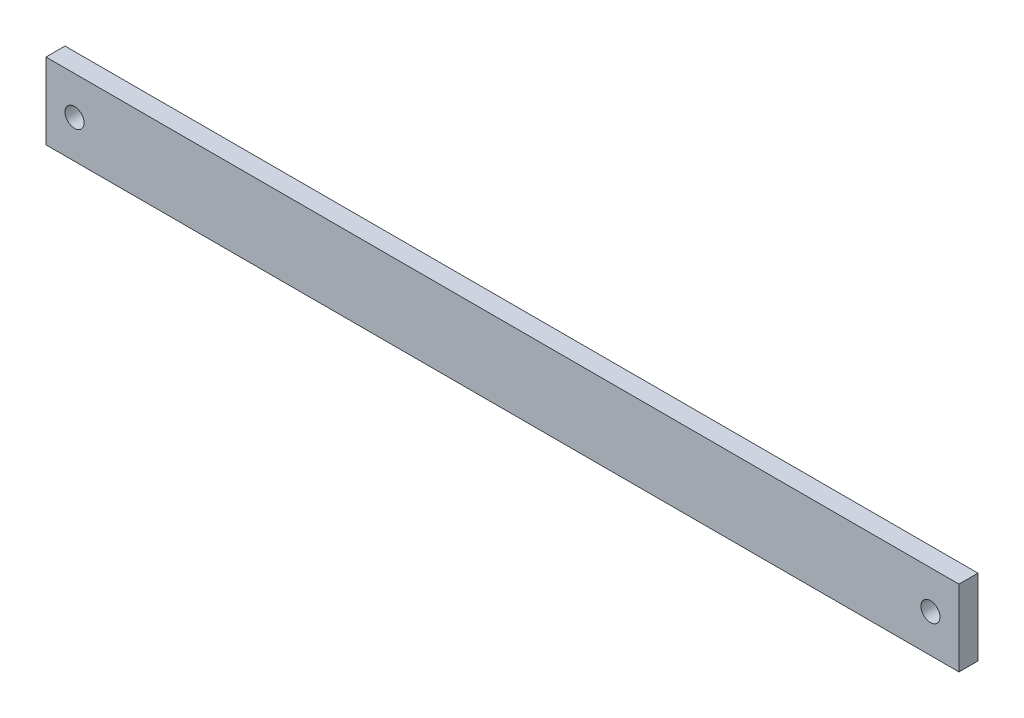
ISO-10303-21;
HEADER;
FILE_DESCRIPTION(('STEP AP214'),'2;1');
FILE_NAME('part.step','',(''),(''),'','','');
FILE_SCHEMA(('AUTOMOTIVE_DESIGN { 1 0 10303 214 1 1 1 1 }'));
ENDSEC;
DATA;
#1=APPLICATION_CONTEXT('core data for automotive mechanical design processes');
#2=APPLICATION_PROTOCOL_DEFINITION('international standard','automotive_design',2000,#1);
#3=PRODUCT_CONTEXT('',#1,'mechanical');
#4=PRODUCT('Part','Part','',(#3));
#5=PRODUCT_RELATED_PRODUCT_CATEGORY('part','',(#4));
#6=PRODUCT_DEFINITION_FORMATION('','',#4);
#7=PRODUCT_DEFINITION_CONTEXT('part definition',#1,'design');
#8=PRODUCT_DEFINITION('design','',#6,#7);
#9=PRODUCT_DEFINITION_SHAPE('','',#8);
#10=(LENGTH_UNIT() NAMED_UNIT(*) SI_UNIT(.MILLI.,.METRE.));
#11=(NAMED_UNIT(*) PLANE_ANGLE_UNIT() SI_UNIT($,.RADIAN.));
#12=(NAMED_UNIT(*) SI_UNIT($,.STERADIAN.) SOLID_ANGLE_UNIT());
#13=UNCERTAINTY_MEASURE_WITH_UNIT(LENGTH_MEASURE(1.E-05),#10,'distance_accuracy_value','');
#14=(GEOMETRIC_REPRESENTATION_CONTEXT(3) GLOBAL_UNCERTAINTY_ASSIGNED_CONTEXT((#13)) GLOBAL_UNIT_ASSIGNED_CONTEXT((#10,
#11,#12)) REPRESENTATION_CONTEXT('',''));
#15=CARTESIAN_POINT('',(0.,0.,0.));
#16=DIRECTION('',(0.,0.,1.));
#17=DIRECTION('',(1.,0.,0.));
#18=AXIS2_PLACEMENT_3D('',#15,#16,#17);
#19=CARTESIAN_POINT('',(-152.4,307.975,6.35));
#20=DIRECTION('',(1.,0.,0.));
#21=DIRECTION('',(0.,0.,-1.));
#22=AXIS2_PLACEMENT_3D('',#19,#20,#21);
#23=PLANE('',#22);
#24=DIRECTION('',(0.,-1.,0.));
#25=VECTOR('',#24,1.);
#26=CARTESIAN_POINT('',(-152.4,307.975,0.));
#27=LINE('',#26,#25);
#28=CARTESIAN_POINT('',(-152.4,307.975,0.));
#29=VERTEX_POINT('',#28);
#30=CARTESIAN_POINT('',(-152.4,282.575,0.));
#31=VERTEX_POINT('',#30);
#32=EDGE_CURVE('E94',#29,#31,#27,.T.);
#33=ORIENTED_EDGE('',*,*,#32,.T.);
#34=DIRECTION('',(0.,0.,-1.));
#35=VECTOR('',#34,1.);
#36=CARTESIAN_POINT('',(-152.4,282.575,6.35));
#37=LINE('',#36,#35);
#38=CARTESIAN_POINT('',(-152.4,282.575,6.35));
#39=VERTEX_POINT('',#38);
#40=EDGE_CURVE('E11',#39,#31,#37,.T.);
#41=ORIENTED_EDGE('',*,*,#40,.F.);
#42=DIRECTION('',(0.,-1.,0.));
#43=VECTOR('',#42,1.);
#44=CARTESIAN_POINT('',(-152.4,307.975,6.35));
#45=LINE('',#44,#43);
#46=CARTESIAN_POINT('',(-152.4,307.975,6.35));
#47=VERTEX_POINT('',#46);
#48=EDGE_CURVE('E82',#47,#39,#45,.T.);
#49=ORIENTED_EDGE('',*,*,#48,.F.);
#50=DIRECTION('',(0.,0.,-1.));
#51=VECTOR('',#50,1.);
#52=CARTESIAN_POINT('',(-152.4,307.975,6.35));
#53=LINE('',#52,#51);
#54=EDGE_CURVE('E90',#47,#29,#53,.T.);
#55=ORIENTED_EDGE('',*,*,#54,.T.);
#56=EDGE_LOOP('',(#33,#41,#49,#55));
#57=FACE_BOUND('',#56,.T.);
#58=ADVANCED_FACE('F31',(#57),#23,.F.);
#59=CARTESIAN_POINT('',(-152.4,282.575,6.35));
#60=DIRECTION('',(0.,1.,0.));
#61=DIRECTION('',(0.,0.,1.));
#62=AXIS2_PLACEMENT_3D('',#59,#60,#61);
#63=PLANE('',#62);
#64=DIRECTION('',(1.,0.,0.));
#65=VECTOR('',#64,1.);
#66=CARTESIAN_POINT('',(-152.4,282.575,0.));
#67=LINE('',#66,#65);
#68=CARTESIAN_POINT('',(152.4,282.575,0.));
#69=VERTEX_POINT('',#68);
#70=EDGE_CURVE('E86',#31,#69,#67,.T.);
#71=ORIENTED_EDGE('',*,*,#70,.T.);
#72=DIRECTION('',(0.,0.,-1.));
#73=VECTOR('',#72,1.);
#74=CARTESIAN_POINT('',(152.4,282.575,6.35));
#75=LINE('',#74,#73);
#76=CARTESIAN_POINT('',(152.4,282.575,6.35));
#77=VERTEX_POINT('',#76);
#78=EDGE_CURVE('E39',#77,#69,#75,.T.);
#79=ORIENTED_EDGE('',*,*,#78,.F.);
#80=DIRECTION('',(1.,0.,0.));
#81=VECTOR('',#80,1.);
#82=CARTESIAN_POINT('',(-152.4,282.575,6.35));
#83=LINE('',#82,#81);
#84=EDGE_CURVE('E77',#39,#77,#83,.T.);
#85=ORIENTED_EDGE('',*,*,#84,.F.);
#86=ORIENTED_EDGE('',*,*,#40,.T.);
#87=EDGE_LOOP('',(#71,#79,#85,#86));
#88=FACE_BOUND('',#87,.T.);
#89=ADVANCED_FACE('F85',(#88),#63,.F.);
#90=CARTESIAN_POINT('',(152.4,307.975,6.35));
#91=DIRECTION('',(-1.,0.,0.));
#92=DIRECTION('',(0.,0.,1.));
#93=AXIS2_PLACEMENT_3D('',#90,#91,#92);
#94=PLANE('',#93);
#95=DIRECTION('',(0.,1.,0.));
#96=VECTOR('',#95,1.);
#97=CARTESIAN_POINT('',(152.4,307.975,0.));
#98=LINE('',#97,#96);
#99=CARTESIAN_POINT('',(152.4,307.975,0.));
#100=VERTEX_POINT('',#99);
#101=EDGE_CURVE('E64',#69,#100,#98,.T.);
#102=ORIENTED_EDGE('',*,*,#101,.T.);
#103=DIRECTION('',(0.,0.,-1.));
#104=VECTOR('',#103,1.);
#105=CARTESIAN_POINT('',(152.4,307.975,6.35));
#106=LINE('',#105,#104);
#107=CARTESIAN_POINT('',(152.4,307.975,6.35));
#108=VERTEX_POINT('',#107);
#109=EDGE_CURVE('E87',#108,#100,#106,.T.);
#110=ORIENTED_EDGE('',*,*,#109,.F.);
#111=DIRECTION('',(0.,1.,0.));
#112=VECTOR('',#111,1.);
#113=CARTESIAN_POINT('',(152.4,307.975,6.35));
#114=LINE('',#113,#112);
#115=EDGE_CURVE('E80',#77,#108,#114,.T.);
#116=ORIENTED_EDGE('',*,*,#115,.F.);
#117=ORIENTED_EDGE('',*,*,#78,.T.);
#118=EDGE_LOOP('',(#102,#110,#116,#117));
#119=FACE_BOUND('',#118,.T.);
#120=ADVANCED_FACE('F88',(#119),#94,.F.);
#121=CARTESIAN_POINT('',(-152.4,307.975,6.35));
#122=DIRECTION('',(0.,-1.,0.));
#123=DIRECTION('',(0.,0.,-1.));
#124=AXIS2_PLACEMENT_3D('',#121,#122,#123);
#125=PLANE('',#124);
#126=DIRECTION('',(-1.,0.,0.));
#127=VECTOR('',#126,1.);
#128=CARTESIAN_POINT('',(-152.4,307.975,0.));
#129=LINE('',#128,#127);
#130=EDGE_CURVE('E70',#100,#29,#129,.T.);
#131=ORIENTED_EDGE('',*,*,#130,.T.);
#132=ORIENTED_EDGE('',*,*,#54,.F.);
#133=DIRECTION('',(-1.,0.,0.));
#134=VECTOR('',#133,1.);
#135=CARTESIAN_POINT('',(-152.4,307.975,6.35));
#136=LINE('',#135,#134);
#137=EDGE_CURVE('E47',#108,#47,#136,.T.);
#138=ORIENTED_EDGE('',*,*,#137,.F.);
#139=ORIENTED_EDGE('',*,*,#109,.T.);
#140=EDGE_LOOP('',(#131,#132,#138,#139));
#141=FACE_BOUND('',#140,.T.);
#142=ADVANCED_FACE('F102',(#141),#125,.F.);
#143=CARTESIAN_POINT('',(-152.4,282.575,6.35));
#144=DIRECTION('',(0.,0.,1.));
#145=DIRECTION('',(1.,0.,0.));
#146=AXIS2_PLACEMENT_3D('',#143,#144,#145);
#147=PLANE('',#146);
#148=CARTESIAN_POINT('',(-142.875,295.275,6.35));
#149=DIRECTION('',(0.,0.,1.));
#150=DIRECTION('',(-1.,0.,0.));
#151=AXIS2_PLACEMENT_3D('',#148,#149,#150);
#152=CIRCLE('',#151,3.175);
#153=CARTESIAN_POINT('',(-146.05,295.275,6.35));
#154=VERTEX_POINT('',#153);
#155=EDGE_CURVE('E114',#154,#154,#152,.T.);
#156=ORIENTED_EDGE('',*,*,#155,.F.);
#157=EDGE_LOOP('',(#156));
#158=FACE_BOUND('',#157,.T.);
#159=CARTESIAN_POINT('',(142.875,295.275,6.35));
#160=DIRECTION('',(0.,0.,1.));
#161=DIRECTION('',(1.,0.,0.));
#162=AXIS2_PLACEMENT_3D('',#159,#160,#161);
#163=CIRCLE('',#162,3.175);
#164=CARTESIAN_POINT('',(146.05,295.275,6.35));
#165=VERTEX_POINT('',#164);
#166=EDGE_CURVE('E108',#165,#165,#163,.T.);
#167=ORIENTED_EDGE('',*,*,#166,.F.);
#168=EDGE_LOOP('',(#167));
#169=FACE_BOUND('',#168,.T.);
#170=ORIENTED_EDGE('',*,*,#48,.T.);
#171=ORIENTED_EDGE('',*,*,#84,.T.);
#172=ORIENTED_EDGE('',*,*,#115,.T.);
#173=ORIENTED_EDGE('',*,*,#137,.T.);
#174=EDGE_LOOP('',(#170,#171,#172,#173));
#175=FACE_BOUND('',#174,.T.);
#176=ADVANCED_FACE('F78',(#158,#169,#175),#147,.T.);
#177=CARTESIAN_POINT('',(-152.4,282.575,0.));
#178=DIRECTION('',(0.,0.,1.));
#179=DIRECTION('',(1.,0.,0.));
#180=AXIS2_PLACEMENT_3D('',#177,#178,#179);
#181=PLANE('',#180);
#182=CARTESIAN_POINT('',(-142.875,295.275,0.));
#183=DIRECTION('',(0.,0.,1.));
#184=DIRECTION('',(-1.,0.,0.));
#185=AXIS2_PLACEMENT_3D('',#182,#183,#184);
#186=CIRCLE('',#185,3.175);
#187=CARTESIAN_POINT('',(-146.05,295.275,0.));
#188=VERTEX_POINT('',#187);
#189=EDGE_CURVE('E111',#188,#188,#186,.T.);
#190=ORIENTED_EDGE('',*,*,#189,.T.);
#191=EDGE_LOOP('',(#190));
#192=FACE_BOUND('',#191,.T.);
#193=CARTESIAN_POINT('',(142.875,295.275,0.));
#194=DIRECTION('',(0.,0.,1.));
#195=DIRECTION('',(1.,0.,0.));
#196=AXIS2_PLACEMENT_3D('',#193,#194,#195);
#197=CIRCLE('',#196,3.175);
#198=CARTESIAN_POINT('',(146.05,295.275,0.));
#199=VERTEX_POINT('',#198);
#200=EDGE_CURVE('E97',#199,#199,#197,.T.);
#201=ORIENTED_EDGE('',*,*,#200,.T.);
#202=EDGE_LOOP('',(#201));
#203=FACE_BOUND('',#202,.T.);
#204=ORIENTED_EDGE('',*,*,#32,.F.);
#205=ORIENTED_EDGE('',*,*,#130,.F.);
#206=ORIENTED_EDGE('',*,*,#101,.F.);
#207=ORIENTED_EDGE('',*,*,#70,.F.);
#208=EDGE_LOOP('',(#204,#205,#206,#207));
#209=FACE_BOUND('',#208,.T.);
#210=ADVANCED_FACE('F105',(#192,#203,#209),#181,.F.);
#211=CARTESIAN_POINT('',(142.875,295.275,0.));
#212=DIRECTION('',(0.,0.,1.));
#213=DIRECTION('',(1.,0.,0.));
#214=AXIS2_PLACEMENT_3D('',#211,#212,#213);
#215=CYLINDRICAL_SURFACE('',#214,3.175);
#216=ORIENTED_EDGE('',*,*,#200,.F.);
#217=EDGE_LOOP('',(#216));
#218=FACE_BOUND('',#217,.T.);
#219=ORIENTED_EDGE('',*,*,#166,.T.);
#220=EDGE_LOOP('',(#219));
#221=FACE_BOUND('',#220,.T.);
#222=ADVANCED_FACE('F125',(#218,#221),#215,.F.);
#223=CARTESIAN_POINT('',(-142.875,295.275,0.));
#224=DIRECTION('',(0.,0.,1.));
#225=DIRECTION('',(1.,0.,0.));
#226=AXIS2_PLACEMENT_3D('',#223,#224,#225);
#227=CYLINDRICAL_SURFACE('',#226,3.175);
#228=ORIENTED_EDGE('',*,*,#189,.F.);
#229=EDGE_LOOP('',(#228));
#230=FACE_BOUND('',#229,.T.);
#231=ORIENTED_EDGE('',*,*,#155,.T.);
#232=EDGE_LOOP('',(#231));
#233=FACE_BOUND('',#232,.T.);
#234=ADVANCED_FACE('F122',(#230,#233),#227,.F.);
#235=CLOSED_SHELL('',(#58,#89,#120,#142,#176,#210,#222,#234));
#236=MANIFOLD_SOLID_BREP('B2',#235);
#237=ADVANCED_BREP_SHAPE_REPRESENTATION('',(#18,#236),#14);
#238=SHAPE_DEFINITION_REPRESENTATION(#9,#237);
ENDSEC;
END-ISO-10303-21;
